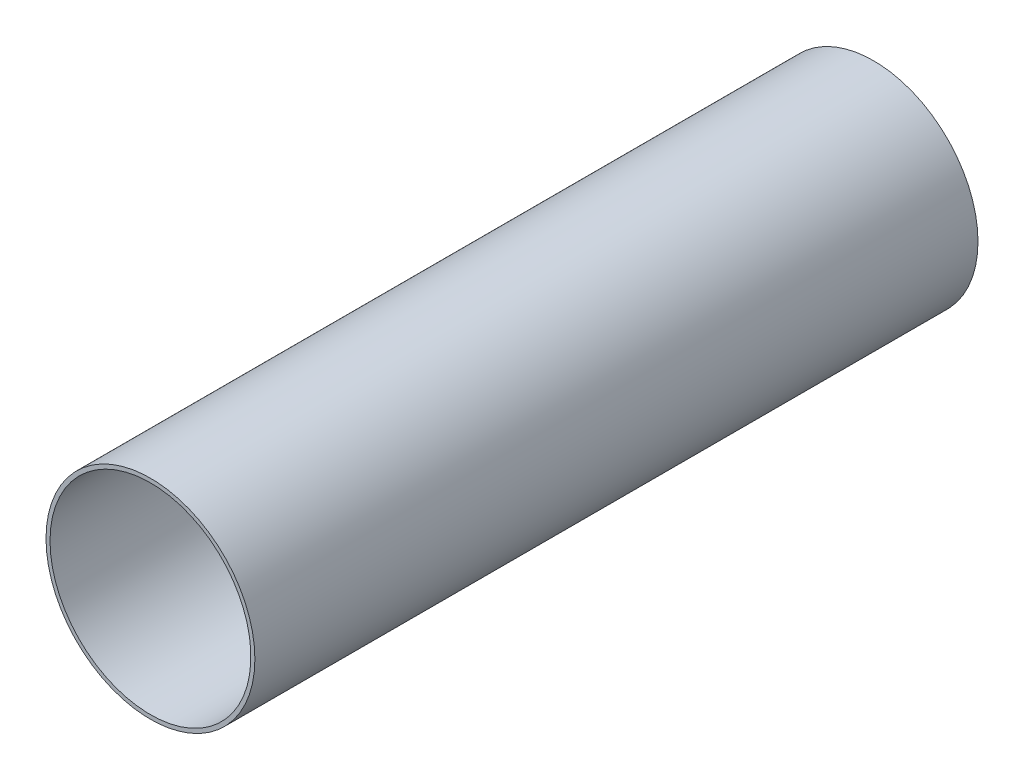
ISO-10303-21;
HEADER;
FILE_DESCRIPTION(('STEP AP214'),'2;1');
FILE_NAME('part.step','',(''),(''),'','','');
FILE_SCHEMA(('AUTOMOTIVE_DESIGN { 1 0 10303 214 1 1 1 1 }'));
ENDSEC;
DATA;
#1=APPLICATION_CONTEXT('core data for automotive mechanical design processes');
#2=APPLICATION_PROTOCOL_DEFINITION('international standard','automotive_design',2000,#1);
#3=PRODUCT_CONTEXT('',#1,'mechanical');
#4=PRODUCT('Part','Part','',(#3));
#5=PRODUCT_RELATED_PRODUCT_CATEGORY('part','',(#4));
#6=PRODUCT_DEFINITION_FORMATION('','',#4);
#7=PRODUCT_DEFINITION_CONTEXT('part definition',#1,'design');
#8=PRODUCT_DEFINITION('design','',#6,#7);
#9=PRODUCT_DEFINITION_SHAPE('','',#8);
#10=(LENGTH_UNIT() NAMED_UNIT(*) SI_UNIT(.MILLI.,.METRE.));
#11=(NAMED_UNIT(*) PLANE_ANGLE_UNIT() SI_UNIT($,.RADIAN.));
#12=(NAMED_UNIT(*) SI_UNIT($,.STERADIAN.) SOLID_ANGLE_UNIT());
#13=UNCERTAINTY_MEASURE_WITH_UNIT(LENGTH_MEASURE(1.E-05),#10,'distance_accuracy_value','');
#14=(GEOMETRIC_REPRESENTATION_CONTEXT(3) GLOBAL_UNCERTAINTY_ASSIGNED_CONTEXT((#13)) GLOBAL_UNIT_ASSIGNED_CONTEXT((#10,
#11,#12)) REPRESENTATION_CONTEXT('',''));
#15=CARTESIAN_POINT('',(0.,0.,0.));
#16=DIRECTION('',(0.,0.,1.));
#17=DIRECTION('',(1.,0.,0.));
#18=AXIS2_PLACEMENT_3D('',#15,#16,#17);
#19=CARTESIAN_POINT('',(0.,0.,90.));
#20=DIRECTION('',(0.,0.,1.));
#21=DIRECTION('',(1.,0.,0.));
#22=AXIS2_PLACEMENT_3D('',#19,#20,#21);
#23=PLANE('',#22);
#24=CARTESIAN_POINT('',(0.,0.,90.));
#25=DIRECTION('',(0.,0.,1.));
#26=DIRECTION('',(1.,0.,0.));
#27=AXIS2_PLACEMENT_3D('',#24,#25,#26);
#28=CIRCLE('',#27,26.);
#29=CARTESIAN_POINT('',(-26.,0.,90.));
#30=VERTEX_POINT('',#29);
#31=EDGE_CURVE('E10',#30,#30,#28,.T.);
#32=ORIENTED_EDGE('',*,*,#31,.T.);
#33=EDGE_LOOP('',(#32));
#34=FACE_BOUND('',#33,.T.);
#35=CARTESIAN_POINT('',(0.,0.,90.));
#36=DIRECTION('',(0.,0.,1.));
#37=DIRECTION('',(1.,0.,0.));
#38=AXIS2_PLACEMENT_3D('',#35,#36,#37);
#39=CIRCLE('',#38,25.);
#40=CARTESIAN_POINT('',(-25.,0.,90.));
#41=VERTEX_POINT('',#40);
#42=EDGE_CURVE('E41',#41,#41,#39,.T.);
#43=ORIENTED_EDGE('',*,*,#42,.F.);
#44=EDGE_LOOP('',(#43));
#45=FACE_BOUND('',#44,.T.);
#46=ADVANCED_FACE('F34',(#34,#45),#23,.T.);
#47=CARTESIAN_POINT('',(0.,0.,90.));
#48=DIRECTION('',(0.,0.,-1.));
#49=DIRECTION('',(-1.,0.,0.));
#50=AXIS2_PLACEMENT_3D('',#47,#48,#49);
#51=CYLINDRICAL_SURFACE('',#50,26.);
#52=CARTESIAN_POINT('',(0.,0.,-90.));
#53=DIRECTION('',(0.,0.,1.));
#54=DIRECTION('',(1.,0.,0.));
#55=AXIS2_PLACEMENT_3D('',#52,#53,#54);
#56=CIRCLE('',#55,26.);
#57=CARTESIAN_POINT('',(-26.,0.,-90.));
#58=VERTEX_POINT('',#57);
#59=EDGE_CURVE('E45',#58,#58,#56,.T.);
#60=CARTESIAN_POINT('',(-26.,0.,90.));
#61=CARTESIAN_POINT('',(-26.,0.,88.125));
#62=CARTESIAN_POINT('',(-26.,0.,86.25));
#63=CARTESIAN_POINT('',(-26.,0.,82.5));
#64=CARTESIAN_POINT('',(-26.,0.,80.625));
#65=CARTESIAN_POINT('',(-26.,0.,76.875));
#66=CARTESIAN_POINT('',(-26.,0.,75.));
#67=CARTESIAN_POINT('',(-26.,0.,71.25));
#68=CARTESIAN_POINT('',(-26.,0.,69.375));
#69=CARTESIAN_POINT('',(-26.,0.,65.625));
#70=CARTESIAN_POINT('',(-26.,0.,63.75));
#71=CARTESIAN_POINT('',(-26.,0.,60.));
#72=CARTESIAN_POINT('',(-26.,0.,58.125));
#73=CARTESIAN_POINT('',(-26.,0.,54.375));
#74=CARTESIAN_POINT('',(-26.,0.,52.5));
#75=CARTESIAN_POINT('',(-26.,0.,48.75));
#76=CARTESIAN_POINT('',(-26.,0.,46.875));
#77=CARTESIAN_POINT('',(-26.,0.,43.125));
#78=CARTESIAN_POINT('',(-26.,0.,41.25));
#79=CARTESIAN_POINT('',(-26.,0.,37.5));
#80=CARTESIAN_POINT('',(-26.,0.,35.625));
#81=CARTESIAN_POINT('',(-26.,0.,31.875));
#82=CARTESIAN_POINT('',(-26.,0.,30.));
#83=CARTESIAN_POINT('',(-26.,0.,26.25));
#84=CARTESIAN_POINT('',(-26.,0.,24.375));
#85=CARTESIAN_POINT('',(-26.,0.,20.625));
#86=CARTESIAN_POINT('',(-26.,0.,18.75));
#87=CARTESIAN_POINT('',(-26.,0.,15.));
#88=CARTESIAN_POINT('',(-26.,0.,13.125));
#89=CARTESIAN_POINT('',(-26.,0.,9.37499999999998));
#90=CARTESIAN_POINT('',(-26.,0.,7.49999999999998));
#91=CARTESIAN_POINT('',(-26.,0.,3.74999999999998));
#92=CARTESIAN_POINT('',(-26.,0.,1.87499999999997));
#93=CARTESIAN_POINT('',(-26.,0.,-1.87500000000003));
#94=CARTESIAN_POINT('',(-26.,0.,-3.75000000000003));
#95=CARTESIAN_POINT('',(-26.,0.,-7.50000000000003));
#96=CARTESIAN_POINT('',(-26.,0.,-9.37500000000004));
#97=CARTESIAN_POINT('',(-26.,0.,-13.125));
#98=CARTESIAN_POINT('',(-26.,0.,-15.));
#99=CARTESIAN_POINT('',(-26.,0.,-18.75));
#100=CARTESIAN_POINT('',(-26.,0.,-20.625));
#101=CARTESIAN_POINT('',(-26.,0.,-24.375));
#102=CARTESIAN_POINT('',(-26.,0.,-26.25));
#103=CARTESIAN_POINT('',(-26.,0.,-30.));
#104=CARTESIAN_POINT('',(-26.,0.,-31.875));
#105=CARTESIAN_POINT('',(-26.,0.,-35.625));
#106=CARTESIAN_POINT('',(-26.,0.,-37.5));
#107=CARTESIAN_POINT('',(-26.,0.,-41.25));
#108=CARTESIAN_POINT('',(-26.,0.,-43.125));
#109=CARTESIAN_POINT('',(-26.,0.,-46.875));
#110=CARTESIAN_POINT('',(-26.,0.,-48.75));
#111=CARTESIAN_POINT('',(-26.,0.,-52.5));
#112=CARTESIAN_POINT('',(-26.,0.,-54.375));
#113=CARTESIAN_POINT('',(-26.,0.,-58.125));
#114=CARTESIAN_POINT('',(-26.,0.,-60.));
#115=CARTESIAN_POINT('',(-26.,0.,-63.75));
#116=CARTESIAN_POINT('',(-26.,0.,-65.625));
#117=CARTESIAN_POINT('',(-26.,0.,-69.375));
#118=CARTESIAN_POINT('',(-26.,0.,-71.25));
#119=CARTESIAN_POINT('',(-26.,0.,-75.));
#120=CARTESIAN_POINT('',(-26.,0.,-76.875));
#121=CARTESIAN_POINT('',(-26.,0.,-80.625));
#122=CARTESIAN_POINT('',(-26.,0.,-82.5));
#123=CARTESIAN_POINT('',(-26.,0.,-86.25));
#124=CARTESIAN_POINT('',(-26.,0.,-88.125));
#125=CARTESIAN_POINT('',(-26.,0.,-90.));
#126=B_SPLINE_CURVE_WITH_KNOTS('',3,(#60,#61,#62,#63,#64,#65,#66,#67,#68,#69,#70,#71,#72,#73,
#74,#75,#76,#77,#78,#79,#80,#81,#82,#83,#84,#85,#86,#87,#88,#89,#90,#91,#92,#93,#94,#95,#96,#97,
#98,#99,#100,#101,#102,#103,#104,#105,#106,#107,#108,#109,#110,#111,#112,#113,#114,#115,#116,
#117,#118,#119,#120,#121,#122,#123,#124,#125),.UNSPECIFIED.,.F.,.F.,(4,2,2,2,2,2,2,2,2,2,2,2,2,
2,2,2,2,2,2,2,2,2,2,2,2,2,2,2,2,2,2,2,4),(0.,5.62499999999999,11.25,16.875,22.5,28.125,33.75,
39.375,45.,50.625,56.25,61.875,67.5,73.125,78.75,84.375,90.,95.625,101.25,106.875,112.5,118.125,
123.75,129.375,135.,140.625,146.25,151.875,157.5,163.125,168.75,174.375,180.),.UNSPECIFIED.);
#127=EDGE_CURVE('BSEAM36',#30,#58,#126,.T.);
#128=ORIENTED_EDGE('',*,*,#31,.F.);
#129=ORIENTED_EDGE('',*,*,#59,.T.);
#130=ORIENTED_EDGE('',*,*,#127,.T.);
#131=ORIENTED_EDGE('',*,*,#127,.F.);
#132=EDGE_LOOP('',(#128,#130,#129,#131));
#133=FACE_BOUND('',#132,.T.);
#134=ADVANCED_FACE('F36',(#133),#51,.T.);
#135=CARTESIAN_POINT('',(0.,0.,90.));
#136=DIRECTION('',(0.,0.,-1.));
#137=DIRECTION('',(-1.,0.,0.));
#138=AXIS2_PLACEMENT_3D('',#135,#136,#137);
#139=CYLINDRICAL_SURFACE('',#138,25.);
#140=CARTESIAN_POINT('',(0.,0.,-90.));
#141=DIRECTION('',(0.,0.,1.));
#142=DIRECTION('',(1.,0.,0.));
#143=AXIS2_PLACEMENT_3D('',#140,#141,#142);
#144=CIRCLE('',#143,25.);
#145=CARTESIAN_POINT('',(-25.,0.,-90.));
#146=VERTEX_POINT('',#145);
#147=EDGE_CURVE('E49',#146,#146,#144,.T.);
#148=CARTESIAN_POINT('',(-25.,0.,90.));
#149=CARTESIAN_POINT('',(-25.,0.,88.125));
#150=CARTESIAN_POINT('',(-25.,0.,86.25));
#151=CARTESIAN_POINT('',(-25.,0.,82.5));
#152=CARTESIAN_POINT('',(-25.,0.,80.625));
#153=CARTESIAN_POINT('',(-25.,0.,76.875));
#154=CARTESIAN_POINT('',(-25.,0.,75.));
#155=CARTESIAN_POINT('',(-25.,0.,71.25));
#156=CARTESIAN_POINT('',(-25.,0.,69.375));
#157=CARTESIAN_POINT('',(-25.,0.,65.625));
#158=CARTESIAN_POINT('',(-25.,0.,63.75));
#159=CARTESIAN_POINT('',(-25.,0.,60.));
#160=CARTESIAN_POINT('',(-25.,0.,58.125));
#161=CARTESIAN_POINT('',(-25.,0.,54.375));
#162=CARTESIAN_POINT('',(-25.,0.,52.5));
#163=CARTESIAN_POINT('',(-25.,0.,48.75));
#164=CARTESIAN_POINT('',(-25.,0.,46.875));
#165=CARTESIAN_POINT('',(-25.,0.,43.125));
#166=CARTESIAN_POINT('',(-25.,0.,41.25));
#167=CARTESIAN_POINT('',(-25.,0.,37.5));
#168=CARTESIAN_POINT('',(-25.,0.,35.625));
#169=CARTESIAN_POINT('',(-25.,0.,31.875));
#170=CARTESIAN_POINT('',(-25.,0.,30.));
#171=CARTESIAN_POINT('',(-25.,0.,26.25));
#172=CARTESIAN_POINT('',(-25.,0.,24.375));
#173=CARTESIAN_POINT('',(-25.,0.,20.625));
#174=CARTESIAN_POINT('',(-25.,0.,18.75));
#175=CARTESIAN_POINT('',(-25.,0.,15.));
#176=CARTESIAN_POINT('',(-25.,0.,13.125));
#177=CARTESIAN_POINT('',(-25.,0.,9.37499999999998));
#178=CARTESIAN_POINT('',(-25.,0.,7.49999999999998));
#179=CARTESIAN_POINT('',(-25.,0.,3.74999999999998));
#180=CARTESIAN_POINT('',(-25.,0.,1.87499999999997));
#181=CARTESIAN_POINT('',(-25.,0.,-1.87500000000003));
#182=CARTESIAN_POINT('',(-25.,0.,-3.75000000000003));
#183=CARTESIAN_POINT('',(-25.,0.,-7.50000000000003));
#184=CARTESIAN_POINT('',(-25.,0.,-9.37500000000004));
#185=CARTESIAN_POINT('',(-25.,0.,-13.125));
#186=CARTESIAN_POINT('',(-25.,0.,-15.));
#187=CARTESIAN_POINT('',(-25.,0.,-18.75));
#188=CARTESIAN_POINT('',(-25.,0.,-20.625));
#189=CARTESIAN_POINT('',(-25.,0.,-24.375));
#190=CARTESIAN_POINT('',(-25.,0.,-26.25));
#191=CARTESIAN_POINT('',(-25.,0.,-30.));
#192=CARTESIAN_POINT('',(-25.,0.,-31.875));
#193=CARTESIAN_POINT('',(-25.,0.,-35.625));
#194=CARTESIAN_POINT('',(-25.,0.,-37.5));
#195=CARTESIAN_POINT('',(-25.,0.,-41.25));
#196=CARTESIAN_POINT('',(-25.,0.,-43.125));
#197=CARTESIAN_POINT('',(-25.,0.,-46.875));
#198=CARTESIAN_POINT('',(-25.,0.,-48.75));
#199=CARTESIAN_POINT('',(-25.,0.,-52.5));
#200=CARTESIAN_POINT('',(-25.,0.,-54.375));
#201=CARTESIAN_POINT('',(-25.,0.,-58.125));
#202=CARTESIAN_POINT('',(-25.,0.,-60.));
#203=CARTESIAN_POINT('',(-25.,0.,-63.75));
#204=CARTESIAN_POINT('',(-25.,0.,-65.625));
#205=CARTESIAN_POINT('',(-25.,0.,-69.375));
#206=CARTESIAN_POINT('',(-25.,0.,-71.25));
#207=CARTESIAN_POINT('',(-25.,0.,-75.));
#208=CARTESIAN_POINT('',(-25.,0.,-76.875));
#209=CARTESIAN_POINT('',(-25.,0.,-80.625));
#210=CARTESIAN_POINT('',(-25.,0.,-82.5));
#211=CARTESIAN_POINT('',(-25.,0.,-86.25));
#212=CARTESIAN_POINT('',(-25.,0.,-88.125));
#213=CARTESIAN_POINT('',(-25.,0.,-90.));
#214=B_SPLINE_CURVE_WITH_KNOTS('',3,(#148,#149,#150,#151,#152,#153,#154,#155,#156,#157,#158,
#159,#160,#161,#162,#163,#164,#165,#166,#167,#168,#169,#170,#171,#172,#173,#174,#175,#176,#177,
#178,#179,#180,#181,#182,#183,#184,#185,#186,#187,#188,#189,#190,#191,#192,#193,#194,#195,#196,
#197,#198,#199,#200,#201,#202,#203,#204,#205,#206,#207,#208,#209,#210,#211,#212,#213),
.UNSPECIFIED.,.F.,.F.,(4,2,2,2,2,2,2,2,2,2,2,2,2,2,2,2,2,2,2,2,2,2,2,2,2,2,2,2,2,2,2,2,4),(0.,
5.62499999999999,11.25,16.875,22.5,28.125,33.75,39.375,45.,50.625,56.25,61.875,67.5,73.125,
78.75,84.375,90.,95.625,101.25,106.875,112.5,118.125,123.75,129.375,135.,140.625,146.25,151.875,
157.5,163.125,168.75,174.375,180.),.UNSPECIFIED.);
#215=EDGE_CURVE('BSEAM58',#41,#146,#214,.T.);
#216=ORIENTED_EDGE('',*,*,#42,.T.);
#217=ORIENTED_EDGE('',*,*,#147,.F.);
#218=ORIENTED_EDGE('',*,*,#215,.T.);
#219=ORIENTED_EDGE('',*,*,#215,.F.);
#220=EDGE_LOOP('',(#216,#218,#217,#219));
#221=FACE_BOUND('',#220,.T.);
#222=ADVANCED_FACE('F58',(#221),#139,.F.);
#223=CARTESIAN_POINT('',(0.,0.,-90.));
#224=DIRECTION('',(0.,0.,1.));
#225=DIRECTION('',(1.,0.,0.));
#226=AXIS2_PLACEMENT_3D('',#223,#224,#225);
#227=PLANE('',#226);
#228=ORIENTED_EDGE('',*,*,#147,.T.);
#229=EDGE_LOOP('',(#228));
#230=FACE_BOUND('',#229,.T.);
#231=ORIENTED_EDGE('',*,*,#59,.F.);
#232=EDGE_LOOP('',(#231));
#233=FACE_BOUND('',#232,.T.);
#234=ADVANCED_FACE('F55',(#230,#233),#227,.F.);
#235=CLOSED_SHELL('',(#46,#134,#222,#234));
#236=MANIFOLD_SOLID_BREP('B2',#235);
#237=ADVANCED_BREP_SHAPE_REPRESENTATION('',(#18,#236),#14);
#238=SHAPE_DEFINITION_REPRESENTATION(#9,#237);
ENDSEC;
END-ISO-10303-21;
